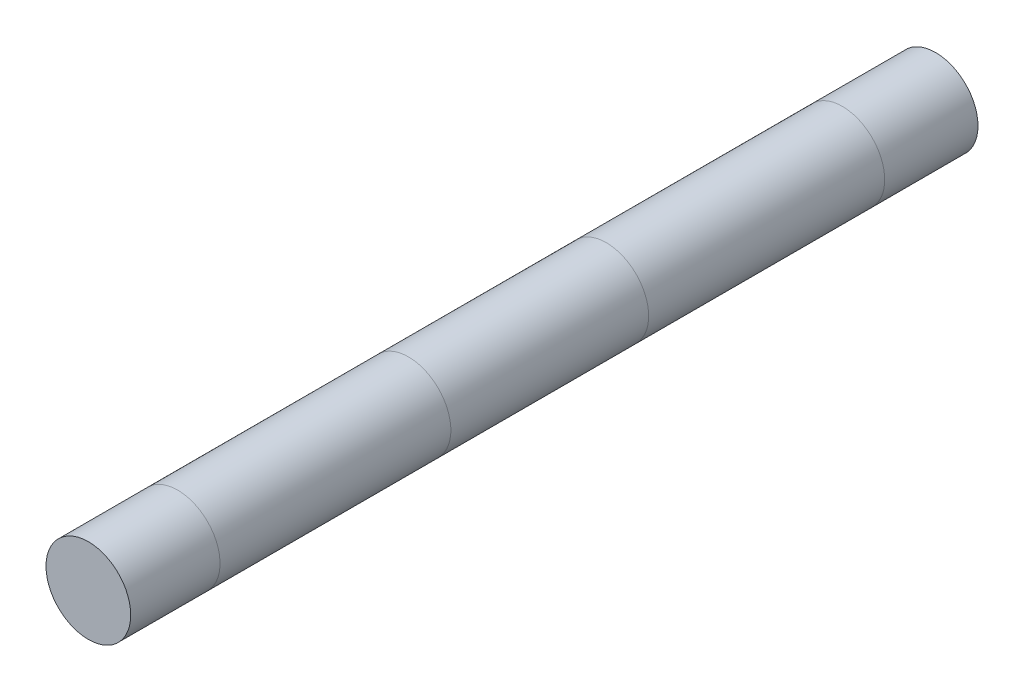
ISO-10303-21;
HEADER;
FILE_DESCRIPTION(('STEP AP214'),'2;1');
FILE_NAME('part.step','',(''),(''),'','','');
FILE_SCHEMA(('AUTOMOTIVE_DESIGN { 1 0 10303 214 1 1 1 1 }'));
ENDSEC;
DATA;
#1=APPLICATION_CONTEXT('core data for automotive mechanical design processes');
#2=APPLICATION_PROTOCOL_DEFINITION('international standard','automotive_design',2000,#1);
#3=PRODUCT_CONTEXT('',#1,'mechanical');
#4=PRODUCT('Part','Part','',(#3));
#5=PRODUCT_RELATED_PRODUCT_CATEGORY('part','',(#4));
#6=PRODUCT_DEFINITION_FORMATION('','',#4);
#7=PRODUCT_DEFINITION_CONTEXT('part definition',#1,'design');
#8=PRODUCT_DEFINITION('design','',#6,#7);
#9=PRODUCT_DEFINITION_SHAPE('','',#8);
#10=(LENGTH_UNIT() NAMED_UNIT(*) SI_UNIT(.MILLI.,.METRE.));
#11=(NAMED_UNIT(*) PLANE_ANGLE_UNIT() SI_UNIT($,.RADIAN.));
#12=(NAMED_UNIT(*) SI_UNIT($,.STERADIAN.) SOLID_ANGLE_UNIT());
#13=UNCERTAINTY_MEASURE_WITH_UNIT(LENGTH_MEASURE(1.E-05),#10,'distance_accuracy_value','');
#14=(GEOMETRIC_REPRESENTATION_CONTEXT(3) GLOBAL_UNCERTAINTY_ASSIGNED_CONTEXT((#13)) GLOBAL_UNIT_ASSIGNED_CONTEXT((#10,
#11,#12)) REPRESENTATION_CONTEXT('',''));
#15=CARTESIAN_POINT('',(0.,0.,0.));
#16=DIRECTION('',(0.,0.,1.));
#17=DIRECTION('',(1.,0.,0.));
#18=AXIS2_PLACEMENT_3D('',#15,#16,#17);
#19=CARTESIAN_POINT('',(0.,0.,254.));
#20=DIRECTION('',(0.,0.,-1.));
#21=DIRECTION('',(-1.,0.,0.));
#22=AXIS2_PLACEMENT_3D('',#19,#20,#21);
#23=CYLINDRICAL_SURFACE('',#22,12.7);
#24=CARTESIAN_POINT('',(0.,0.,254.));
#25=DIRECTION('',(0.,0.,1.));
#26=DIRECTION('',(1.,0.,0.));
#27=AXIS2_PLACEMENT_3D('',#24,#25,#26);
#28=CIRCLE('',#27,12.7);
#29=CARTESIAN_POINT('',(12.7,0.,254.));
#30=VERTEX_POINT('',#29);
#31=EDGE_CURVE('E102',#30,#30,#28,.T.);
#32=ORIENTED_EDGE('',*,*,#31,.F.);
#33=EDGE_LOOP('',(#32));
#34=FACE_BOUND('',#33,.T.);
#35=CARTESIAN_POINT('',(0.,0.,227.223226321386));
#36=DIRECTION('',(0.,0.,-1.));
#37=DIRECTION('',(-1.,0.,0.));
#38=AXIS2_PLACEMENT_3D('',#35,#36,#37);
#39=CIRCLE('',#38,12.7);
#40=CARTESIAN_POINT('',(-12.7,0.,227.223226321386));
#41=VERTEX_POINT('',#40);
#42=EDGE_CURVE('E48',#41,#41,#39,.T.);
#43=ORIENTED_EDGE('',*,*,#42,.F.);
#44=EDGE_LOOP('',(#43));
#45=FACE_BOUND('',#44,.T.);
#46=ADVANCED_FACE('F74',(#34,#45),#23,.T.);
#47=CARTESIAN_POINT('',(0.,0.,98.7319105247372));
#48=DIRECTION('',(0.,0.,-1.));
#49=DIRECTION('',(-1.,0.,0.));
#50=AXIS2_PLACEMENT_3D('',#47,#48,#49);
#51=CIRCLE('',#50,12.7);
#52=CARTESIAN_POINT('',(-12.7,0.,98.7319105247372));
#53=VERTEX_POINT('',#52);
#54=EDGE_CURVE('E90',#53,#53,#51,.T.);
#55=ORIENTED_EDGE('',*,*,#54,.T.);
#56=EDGE_LOOP('',(#55));
#57=FACE_BOUND('',#56,.T.);
#58=CARTESIAN_POINT('',(0.,0.,27.9628473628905));
#59=DIRECTION('',(0.,0.,-1.));
#60=DIRECTION('',(-1.,0.,0.));
#61=AXIS2_PLACEMENT_3D('',#58,#59,#60);
#62=CIRCLE('',#61,12.7);
#63=CARTESIAN_POINT('',(-12.7,0.,27.9628473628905));
#64=VERTEX_POINT('',#63);
#65=EDGE_CURVE('E82',#64,#64,#62,.T.);
#66=ORIENTED_EDGE('',*,*,#65,.F.);
#67=EDGE_LOOP('',(#66));
#68=FACE_BOUND('',#67,.T.);
#69=ADVANCED_FACE('F113',(#57,#68),#23,.T.);
#70=CARTESIAN_POINT('',(0.,0.,158.035594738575));
#71=DIRECTION('',(0.,0.,-1.));
#72=DIRECTION('',(-1.,0.,0.));
#73=AXIS2_PLACEMENT_3D('',#70,#71,#72);
#74=CIRCLE('',#73,12.7);
#75=CARTESIAN_POINT('',(-12.7,0.,158.035594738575));
#76=VERTEX_POINT('',#75);
#77=EDGE_CURVE('E97',#76,#76,#74,.T.);
#78=ORIENTED_EDGE('',*,*,#77,.T.);
#79=EDGE_LOOP('',(#78));
#80=FACE_BOUND('',#79,.T.);
#81=ORIENTED_EDGE('',*,*,#54,.F.);
#82=EDGE_LOOP('',(#81));
#83=FACE_BOUND('',#82,.T.);
#84=ADVANCED_FACE('F117',(#80,#83),#23,.T.);
#85=ORIENTED_EDGE('',*,*,#42,.T.);
#86=EDGE_LOOP('',(#85));
#87=FACE_BOUND('',#86,.T.);
#88=ORIENTED_EDGE('',*,*,#77,.F.);
#89=EDGE_LOOP('',(#88));
#90=FACE_BOUND('',#89,.T.);
#91=ADVANCED_FACE('F119',(#87,#90),#23,.T.);
#92=ORIENTED_EDGE('',*,*,#65,.T.);
#93=EDGE_LOOP('',(#92));
#94=FACE_BOUND('',#93,.T.);
#95=CARTESIAN_POINT('',(0.,0.,0.));
#96=DIRECTION('',(0.,0.,1.));
#97=DIRECTION('',(1.,0.,0.));
#98=AXIS2_PLACEMENT_3D('',#95,#96,#97);
#99=CIRCLE('',#98,12.7);
#100=CARTESIAN_POINT('',(12.7,0.,0.));
#101=VERTEX_POINT('',#100);
#102=EDGE_CURVE('E103',#101,#101,#99,.T.);
#103=ORIENTED_EDGE('',*,*,#102,.T.);
#104=EDGE_LOOP('',(#103));
#105=FACE_BOUND('',#104,.T.);
#106=ADVANCED_FACE('F76',(#94,#105),#23,.T.);
#107=CARTESIAN_POINT('',(0.,0.,254.));
#108=DIRECTION('',(0.,0.,1.));
#109=DIRECTION('',(1.,0.,0.));
#110=AXIS2_PLACEMENT_3D('',#107,#108,#109);
#111=PLANE('',#110);
#112=ORIENTED_EDGE('',*,*,#31,.T.);
#113=EDGE_LOOP('',(#112));
#114=FACE_BOUND('',#113,.T.);
#115=ADVANCED_FACE('F109',(#114),#111,.T.);
#116=CARTESIAN_POINT('',(0.,0.,0.));
#117=DIRECTION('',(0.,0.,1.));
#118=DIRECTION('',(1.,0.,0.));
#119=AXIS2_PLACEMENT_3D('',#116,#117,#118);
#120=PLANE('',#119);
#121=ORIENTED_EDGE('',*,*,#102,.F.);
#122=EDGE_LOOP('',(#121));
#123=FACE_BOUND('',#122,.T.);
#124=ADVANCED_FACE('F123',(#123),#120,.F.);
#125=CLOSED_SHELL('',(#46,#69,#84,#91,#106,#115,#124));
#126=MANIFOLD_SOLID_BREP('B6',#125);
#127=ADVANCED_BREP_SHAPE_REPRESENTATION('',(#18,#126),#14);
#128=SHAPE_DEFINITION_REPRESENTATION(#9,#127);
ENDSEC;
END-ISO-10303-21;
